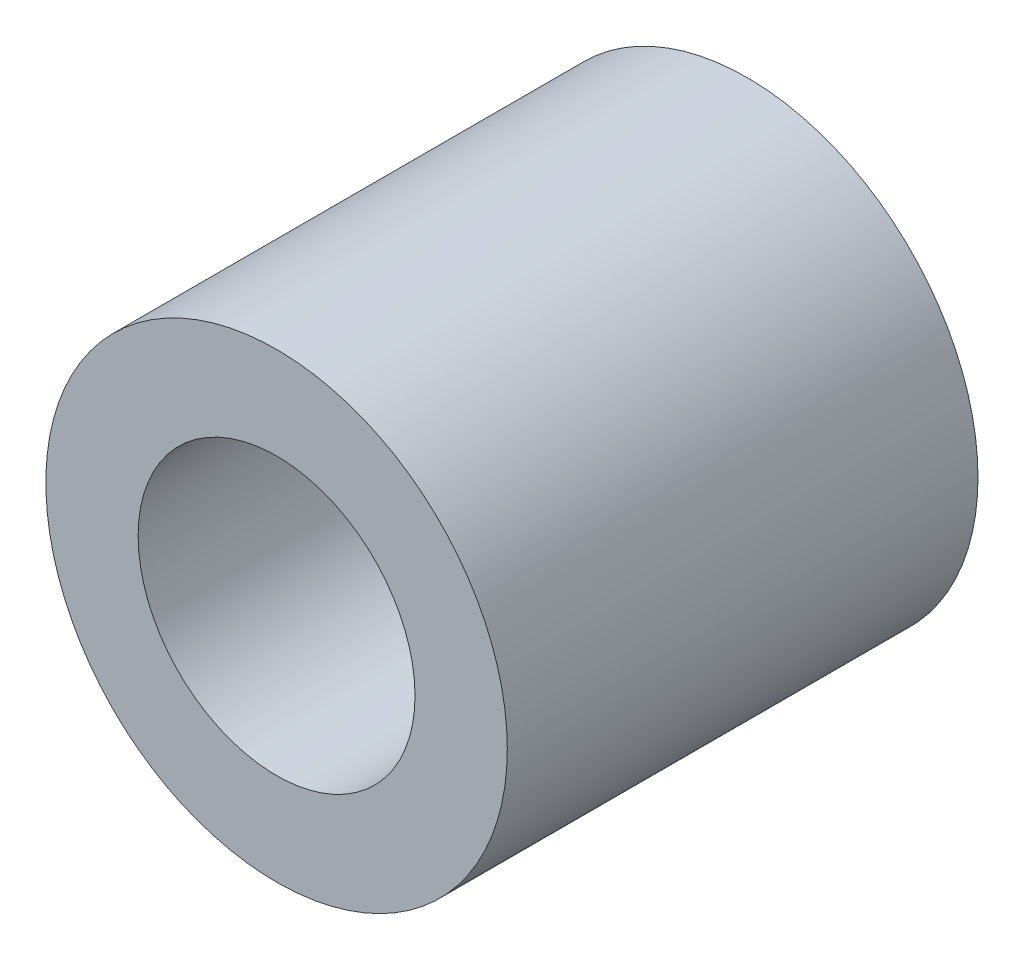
from build123d import *

# Parameters (mm, degrees)
SKETCH1_R          = 2.5
SKETCH1_R_2        = 1.5
BASE_EXTRUDE_DEPTH = 5.1


with BuildPart() as part:
    # Sketch1 → Base-Extrude (new body)
    with BuildSketch(Plane.XY):
        Circle(SKETCH1_R)
        Circle(SKETCH1_R_2, mode=Mode.SUBTRACT)
    extrude(amount=BASE_EXTRUDE_DEPTH)


solid = part.part
